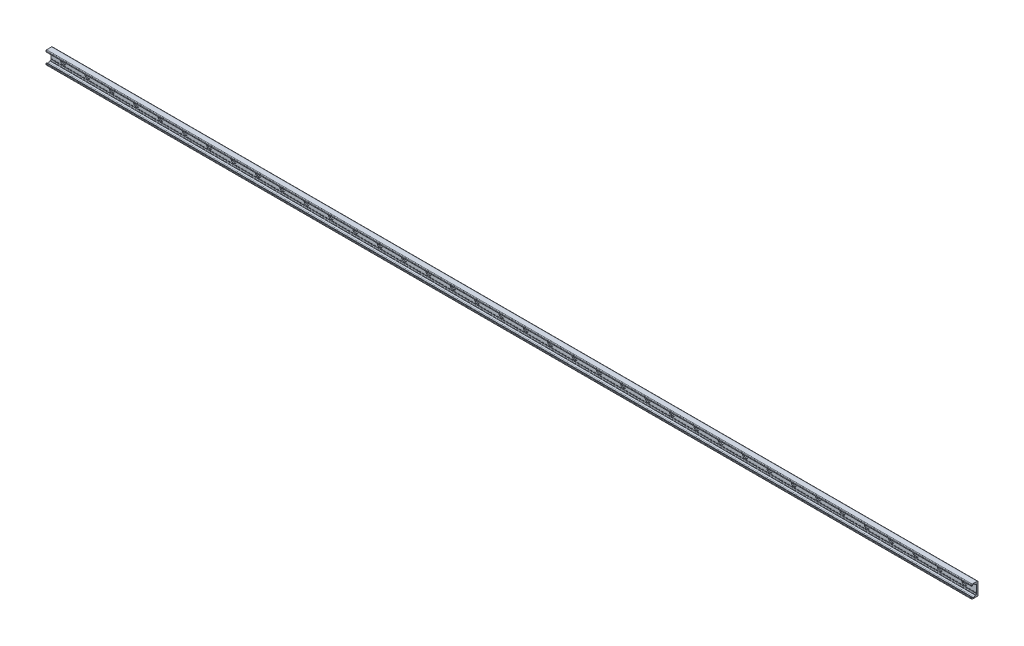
from build123d import *

# Parameters (mm, degrees)
BOSS_EXTRUDE1_DEPTH = 1520
SKETCH2_R           = 9
SKETCH2_R_2         = 4.5
CUT_EXTRUDE1_DEPTH  = 3.1
SKETCH2_2_R         = 4.5
CUT_EXTRUDE2_DEPTH  = 1521.241592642
LPATTERN1_COUNT     = 38
LPATTERN1_PITCH     = 80


with BuildPart() as part:
    # Sketch1 → Boss-Extrude1 (new, symmetric)
    with BuildSketch(Plane(origin=(0, 0, 0), x_dir=(0, 0, -1), z_dir=(1, 0, 0))):
        with BuildLine():
            Line((0, 0), (0, 19))
            ThreePointArc((0, 19), (-0.732233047, 20.767766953), (-2.5, 21.5))
            Line((-2.5, 21.5), (-19, 21.5))
            ThreePointArc((-19, 21.5), (-20.414213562, 20.914213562), (-21, 19.5))
            Line((-21, 19.5), (-21, 16.625057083))
            ThreePointArc((-21, 16.625057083), (-20.553251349, 15.888838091), (-19.693931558, 15.945160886))
            Line((-19.693931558, 15.945160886), (-16.794305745, 17.975500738))
            ThreePointArc((-16.794305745, 17.975500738), (-14.5, 18.69889256), (-12.205694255, 17.975500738))
            Line((-12.205694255, 17.975500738), (-8.829831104, 15.611695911))
            ThreePointArc((-8.829831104, 15.611695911), (-8.28408983, 15.342566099), (-7.682678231, 15.25))
            Line((-7.682678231, 15.25), (-6.5, 15.25))
            ThreePointArc((-6.5, 15.25), (-5.085786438, 14.664213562), (-4.5, 13.25))
            Line((-4.5, 13.25), (-4.5, -10.75))
            ThreePointArc((-4.5, -10.75), (-4.25, -11), (-4.5, -11.25))
            Line((-4.5, -11.25), (-4.5, -12.25))
            ThreePointArc((-4.5, -12.25), (-4.25, -12.5), (-4.5, -12.75))
            Line((-4.5, -12.75), (-4.5, -13.25))
            ThreePointArc((-4.5, -13.25), (-5.085786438, -14.664213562), (-6.5, -15.25))
            Line((-6.5, -15.25), (-7.682678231, -15.25))
            ThreePointArc((-7.682678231, -15.25), (-8.28408983, -15.342566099), (-8.829831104, -15.611695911))
            Line((-8.829831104, -15.611695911), (-12.205694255, -17.975500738))
            ThreePointArc((-12.205694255, -17.975500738), (-14.5, -18.69889256), (-16.794305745, -17.975500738))
            Line((-16.794305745, -17.975500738), (-19.693931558, -15.945160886))
            ThreePointArc((-19.693931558, -15.945160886), (-20.553251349, -15.888838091), (-21, -16.625057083))
            Line((-21, -16.625057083), (-21, -19.5))
            ThreePointArc((-21, -19.5), (-20.414213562, -20.914213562), (-19, -21.5))
            Line((-19, -21.5), (-2.5, -21.5))
            ThreePointArc((-2.5, -21.5), (-0.732233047, -20.767766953), (0, -19))
            Line((0, -19), (0, 0))
        make_face()
    extrude(amount=BOSS_EXTRUDE1_DEPTH, both=True)

    # Sketch2 → Cut-Extrude1 (cut)
    with BuildSketch(Plane.XY.offset(4.5)):
        with Locations((1480, 0)):
            Circle(SKETCH2_R)
        with Locations((1480, 0)):
            Circle(SKETCH2_R_2, mode=Mode.SUBTRACT)
    cut_extrude1 = extrude(amount=-CUT_EXTRUDE1_DEPTH, mode=Mode.SUBTRACT)

    # Sketch2_2 → Cut-Extrude2 (cut, through all)
    with BuildSketch(Plane.XY.offset(4.5)):
        with Locations((1480, 0)):
            Circle(SKETCH2_2_R)
    cut_extrude2 = extrude(amount=-CUT_EXTRUDE2_DEPTH, mode=Mode.SUBTRACT)

    # LPattern1: Cut-Extrude1, Cut-Extrude2 ×38
    with Locations(*[(-i * LPATTERN1_PITCH, 0, 0) for i in range(1, LPATTERN1_COUNT)]):
        add(cut_extrude1, mode=Mode.SUBTRACT)
        add(cut_extrude2, mode=Mode.SUBTRACT)


solid = part.part
